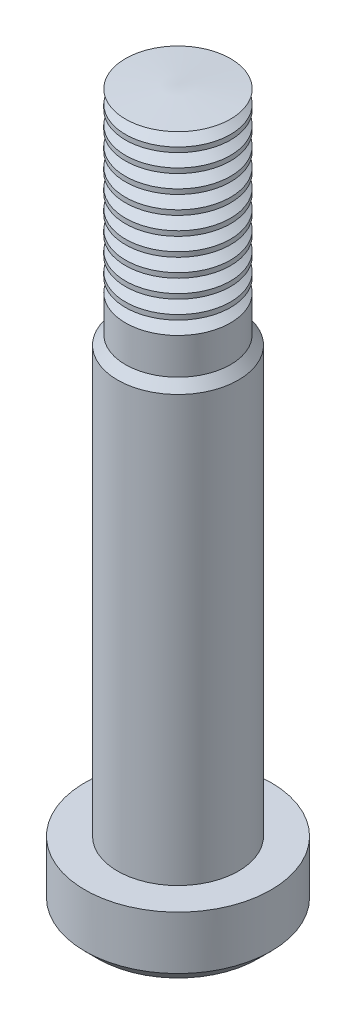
ISO-10303-21;
HEADER;
FILE_DESCRIPTION(('STEP AP214'),'2;1');
FILE_NAME('part.step','',(''),(''),'','','');
FILE_SCHEMA(('AUTOMOTIVE_DESIGN { 1 0 10303 214 1 1 1 1 }'));
ENDSEC;
DATA;
#1=APPLICATION_CONTEXT('core data for automotive mechanical design processes');
#2=APPLICATION_PROTOCOL_DEFINITION('international standard','automotive_design',2000,#1);
#3=PRODUCT_CONTEXT('',#1,'mechanical');
#4=PRODUCT('Part','Part','',(#3));
#5=PRODUCT_RELATED_PRODUCT_CATEGORY('part','',(#4));
#6=PRODUCT_DEFINITION_FORMATION('','',#4);
#7=PRODUCT_DEFINITION_CONTEXT('part definition',#1,'design');
#8=PRODUCT_DEFINITION('design','',#6,#7);
#9=PRODUCT_DEFINITION_SHAPE('','',#8);
#10=(LENGTH_UNIT() NAMED_UNIT(*) SI_UNIT(.MILLI.,.METRE.));
#11=(NAMED_UNIT(*) PLANE_ANGLE_UNIT() SI_UNIT($,.RADIAN.));
#12=(NAMED_UNIT(*) SI_UNIT($,.STERADIAN.) SOLID_ANGLE_UNIT());
#13=UNCERTAINTY_MEASURE_WITH_UNIT(LENGTH_MEASURE(1.E-05),#10,'distance_accuracy_value','');
#14=(GEOMETRIC_REPRESENTATION_CONTEXT(3) GLOBAL_UNCERTAINTY_ASSIGNED_CONTEXT((#13)) GLOBAL_UNIT_ASSIGNED_CONTEXT((#10,
#11,#12)) REPRESENTATION_CONTEXT('',''));
#15=CARTESIAN_POINT('',(0.,0.,0.));
#16=DIRECTION('',(0.,0.,1.));
#17=DIRECTION('',(1.,0.,0.));
#18=AXIS2_PLACEMENT_3D('',#15,#16,#17);
#19=CARTESIAN_POINT('',(0.,53.6722311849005,0.));
#20=DIRECTION('',(0.,-1.,0.));
#21=DIRECTION('',(0.,0.,-1.));
#22=AXIS2_PLACEMENT_3D('',#19,#20,#21);
#23=CONICAL_SURFACE('',#22,4.34610697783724,1.49552217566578);
#24=CARTESIAN_POINT('',(0.,53.9999999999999,0.));
#25=VERTEX_POINT('',#24);
#26=VERTEX_LOOP('',#25);
#27=FACE_BOUND('',#26,.T.);
#28=CARTESIAN_POINT('',(0.,53.7020283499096,0.));
#29=DIRECTION('',(0.,-1.,0.));
#30=DIRECTION('',(0.,0.,-1.));
#31=AXIS2_PLACEMENT_3D('',#28,#29,#30);
#32=CIRCLE('',#31,3.95100634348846);
#33=CARTESIAN_POINT('',(0.,53.7020283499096,-3.95100634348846));
#34=VERTEX_POINT('',#33);
#35=EDGE_CURVE('E35',#34,#34,#32,.T.);
#36=ORIENTED_EDGE('',*,*,#35,.F.);
#37=EDGE_LOOP('',(#36));
#38=FACE_BOUND('',#37,.T.);
#39=ADVANCED_FACE('F17',(#27,#38),#23,.T.);
#40=CARTESIAN_POINT('',(0.,53.7520283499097,0.));
#41=DIRECTION('',(0.,1.,0.));
#42=DIRECTION('',(0.,0.,1.));
#43=AXIS2_PLACEMENT_3D('',#40,#41,#42);
#44=CONICAL_SURFACE('',#43,4.03760888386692,1.04719755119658);
#45=ORIENTED_EDGE('',*,*,#35,.T.);
#46=EDGE_LOOP('',(#45));
#47=FACE_BOUND('',#46,.T.);
#48=CARTESIAN_POINT('',(0.,53.2020283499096,0.));
#49=DIRECTION('',(0.,-1.,0.));
#50=DIRECTION('',(0.,0.,-1.));
#51=AXIS2_PLACEMENT_3D('',#48,#49,#50);
#52=CIRCLE('',#51,3.08498093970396);
#53=CARTESIAN_POINT('',(0.,53.2020283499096,-3.08498093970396));
#54=VERTEX_POINT('',#53);
#55=EDGE_CURVE('E37',#54,#54,#52,.T.);
#56=ORIENTED_EDGE('',*,*,#55,.F.);
#57=EDGE_LOOP('',(#56));
#58=FACE_BOUND('',#57,.T.);
#59=ADVANCED_FACE('F31',(#47,#58),#44,.T.);
#60=CARTESIAN_POINT('',(0.,52.6520283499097,0.));
#61=DIRECTION('',(0.,-1.,0.));
#62=DIRECTION('',(0.,0.,-1.));
#63=AXIS2_PLACEMENT_3D('',#60,#61,#62);
#64=CONICAL_SURFACE('',#63,4.03760888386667,1.04719755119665);
#65=CARTESIAN_POINT('',(0.,52.7020283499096,0.));
#66=DIRECTION('',(0.,-1.,0.));
#67=DIRECTION('',(0.,0.,-1.));
#68=AXIS2_PLACEMENT_3D('',#65,#66,#67);
#69=CIRCLE('',#68,3.95100634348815);
#70=CARTESIAN_POINT('',(0.,52.7020283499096,-3.95100634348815));
#71=VERTEX_POINT('',#70);
#72=EDGE_CURVE('E40',#71,#71,#69,.T.);
#73=ORIENTED_EDGE('',*,*,#72,.F.);
#74=EDGE_LOOP('',(#73));
#75=FACE_BOUND('',#74,.T.);
#76=ORIENTED_EDGE('',*,*,#55,.T.);
#77=EDGE_LOOP('',(#76));
#78=FACE_BOUND('',#77,.T.);
#79=ADVANCED_FACE('F256',(#75,#78),#64,.T.);
#80=CARTESIAN_POINT('',(0.,52.7384667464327,0.));
#81=DIRECTION('',(0.,-1.,0.));
#82=DIRECTION('',(0.,0.,-1.));
#83=AXIS2_PLACEMENT_3D('',#80,#81,#82);
#84=CYLINDRICAL_SURFACE('',#83,3.95100634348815);
#85=CARTESIAN_POINT('',(1.15359111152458E-13,52.3376443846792,0.));
#86=DIRECTION('',(0.,-1.,0.));
#87=DIRECTION('',(0.,0.,-1.));
#88=AXIS2_PLACEMENT_3D('',#85,#86,#87);
#89=CIRCLE('',#88,3.95100634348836);
#90=CARTESIAN_POINT('',(1.15359111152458E-13,52.3376443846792,-3.95100634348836));
#91=VERTEX_POINT('',#90);
#92=EDGE_CURVE('E45',#91,#91,#89,.T.);
#93=ORIENTED_EDGE('',*,*,#92,.F.);
#94=EDGE_LOOP('',(#93));
#95=FACE_BOUND('',#94,.T.);
#96=ORIENTED_EDGE('',*,*,#72,.T.);
#97=EDGE_LOOP('',(#96));
#98=FACE_BOUND('',#97,.T.);
#99=ADVANCED_FACE('F263',(#95,#98),#84,.T.);
#100=CARTESIAN_POINT('',(1.27068494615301E-13,52.3876443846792,0.));
#101=DIRECTION('',(0.,1.,0.));
#102=DIRECTION('',(0.,0.,1.));
#103=AXIS2_PLACEMENT_3D('',#100,#101,#102);
#104=CONICAL_SURFACE('',#103,4.03760888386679,1.04719755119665);
#105=ORIENTED_EDGE('',*,*,#92,.T.);
#106=EDGE_LOOP('',(#105));
#107=FACE_BOUND('',#106,.T.);
#108=CARTESIAN_POINT('',(0.,51.8376443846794,0.));
#109=DIRECTION('',(0.,-1.,0.));
#110=DIRECTION('',(0.,0.,-1.));
#111=AXIS2_PLACEMENT_3D('',#108,#109,#110);
#112=CIRCLE('',#111,3.08498093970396);
#113=CARTESIAN_POINT('',(0.,51.8376443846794,-3.08498093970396));
#114=VERTEX_POINT('',#113);
#115=EDGE_CURVE('E48',#114,#114,#112,.T.);
#116=ORIENTED_EDGE('',*,*,#115,.F.);
#117=EDGE_LOOP('',(#116));
#118=FACE_BOUND('',#117,.T.);
#119=ADVANCED_FACE('F271',(#107,#118),#104,.T.);
#120=CARTESIAN_POINT('',(0.,51.2876443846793,0.));
#121=DIRECTION('',(0.,-1.,0.));
#122=DIRECTION('',(0.,0.,-1.));
#123=AXIS2_PLACEMENT_3D('',#120,#121,#122);
#124=CONICAL_SURFACE('',#123,4.03760888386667,1.04719755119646);
#125=CARTESIAN_POINT('',(0.,51.3376443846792,0.));
#126=DIRECTION('',(0.,-1.,0.));
#127=DIRECTION('',(0.,0.,-1.));
#128=AXIS2_PLACEMENT_3D('',#125,#126,#127);
#129=CIRCLE('',#128,3.95100634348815);
#130=CARTESIAN_POINT('',(0.,51.3376443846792,-3.95100634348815));
#131=VERTEX_POINT('',#130);
#132=EDGE_CURVE('E51',#131,#131,#129,.T.);
#133=ORIENTED_EDGE('',*,*,#132,.F.);
#134=EDGE_LOOP('',(#133));
#135=FACE_BOUND('',#134,.T.);
#136=ORIENTED_EDGE('',*,*,#115,.T.);
#137=EDGE_LOOP('',(#136));
#138=FACE_BOUND('',#137,.T.);
#139=ADVANCED_FACE('F279',(#135,#138),#124,.T.);
#140=CARTESIAN_POINT('',(0.,51.3740827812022,0.));
#141=DIRECTION('',(0.,-1.,0.));
#142=DIRECTION('',(0.,0.,-1.));
#143=AXIS2_PLACEMENT_3D('',#140,#141,#142);
#144=CYLINDRICAL_SURFACE('',#143,3.95100634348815);
#145=CARTESIAN_POINT('',(1.15359111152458E-13,50.9732604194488,0.));
#146=DIRECTION('',(0.,-1.,0.));
#147=DIRECTION('',(0.,0.,-1.));
#148=AXIS2_PLACEMENT_3D('',#145,#146,#147);
#149=CIRCLE('',#148,3.95100634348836);
#150=CARTESIAN_POINT('',(1.15359111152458E-13,50.9732604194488,-3.95100634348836));
#151=VERTEX_POINT('',#150);
#152=EDGE_CURVE('E54',#151,#151,#149,.T.);
#153=ORIENTED_EDGE('',*,*,#152,.F.);
#154=EDGE_LOOP('',(#153));
#155=FACE_BOUND('',#154,.T.);
#156=ORIENTED_EDGE('',*,*,#132,.T.);
#157=EDGE_LOOP('',(#156));
#158=FACE_BOUND('',#157,.T.);
#159=ADVANCED_FACE('F287',(#155,#158),#144,.T.);
#160=CARTESIAN_POINT('',(1.27068494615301E-13,51.0232604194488,0.));
#161=DIRECTION('',(0.,1.,0.));
#162=DIRECTION('',(0.,0.,1.));
#163=AXIS2_PLACEMENT_3D('',#160,#161,#162);
#164=CONICAL_SURFACE('',#163,4.03760888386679,1.04719755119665);
#165=ORIENTED_EDGE('',*,*,#152,.T.);
#166=EDGE_LOOP('',(#165));
#167=FACE_BOUND('',#166,.T.);
#168=CARTESIAN_POINT('',(0.,50.473260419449,0.));
#169=DIRECTION('',(0.,-1.,0.));
#170=DIRECTION('',(0.,0.,-1.));
#171=AXIS2_PLACEMENT_3D('',#168,#169,#170);
#172=CIRCLE('',#171,3.08498093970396);
#173=CARTESIAN_POINT('',(0.,50.473260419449,-3.08498093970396));
#174=VERTEX_POINT('',#173);
#175=EDGE_CURVE('E57',#174,#174,#172,.T.);
#176=ORIENTED_EDGE('',*,*,#175,.F.);
#177=EDGE_LOOP('',(#176));
#178=FACE_BOUND('',#177,.T.);
#179=ADVANCED_FACE('F295',(#167,#178),#164,.T.);
#180=CARTESIAN_POINT('',(0.,49.9232604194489,0.));
#181=DIRECTION('',(0.,-1.,0.));
#182=DIRECTION('',(0.,0.,-1.));
#183=AXIS2_PLACEMENT_3D('',#180,#181,#182);
#184=CONICAL_SURFACE('',#183,4.03760888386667,1.04719755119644);
#185=CARTESIAN_POINT('',(0.,49.9732604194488,0.));
#186=DIRECTION('',(0.,-1.,0.));
#187=DIRECTION('',(0.,0.,-1.));
#188=AXIS2_PLACEMENT_3D('',#185,#186,#187);
#189=CIRCLE('',#188,3.95100634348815);
#190=CARTESIAN_POINT('',(0.,49.9732604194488,-3.95100634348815));
#191=VERTEX_POINT('',#190);
#192=EDGE_CURVE('E60',#191,#191,#189,.T.);
#193=ORIENTED_EDGE('',*,*,#192,.F.);
#194=EDGE_LOOP('',(#193));
#195=FACE_BOUND('',#194,.T.);
#196=ORIENTED_EDGE('',*,*,#175,.T.);
#197=EDGE_LOOP('',(#196));
#198=FACE_BOUND('',#197,.T.);
#199=ADVANCED_FACE('F303',(#195,#198),#184,.T.);
#200=CARTESIAN_POINT('',(0.,50.0096988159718,0.));
#201=DIRECTION('',(0.,-1.,0.));
#202=DIRECTION('',(0.,0.,-1.));
#203=AXIS2_PLACEMENT_3D('',#200,#201,#202);
#204=CYLINDRICAL_SURFACE('',#203,3.95100634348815);
#205=CARTESIAN_POINT('',(1.15359111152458E-13,49.6088764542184,0.));
#206=DIRECTION('',(0.,-1.,0.));
#207=DIRECTION('',(0.,0.,-1.));
#208=AXIS2_PLACEMENT_3D('',#205,#206,#207);
#209=CIRCLE('',#208,3.95100634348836);
#210=CARTESIAN_POINT('',(1.15359111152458E-13,49.6088764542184,-3.95100634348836));
#211=VERTEX_POINT('',#210);
#212=EDGE_CURVE('E63',#211,#211,#209,.T.);
#213=ORIENTED_EDGE('',*,*,#212,.F.);
#214=EDGE_LOOP('',(#213));
#215=FACE_BOUND('',#214,.T.);
#216=ORIENTED_EDGE('',*,*,#192,.T.);
#217=EDGE_LOOP('',(#216));
#218=FACE_BOUND('',#217,.T.);
#219=ADVANCED_FACE('F311',(#215,#218),#204,.T.);
#220=CARTESIAN_POINT('',(1.27068494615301E-13,49.6588764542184,0.));
#221=DIRECTION('',(0.,1.,0.));
#222=DIRECTION('',(0.,0.,1.));
#223=AXIS2_PLACEMENT_3D('',#220,#221,#222);
#224=CONICAL_SURFACE('',#223,4.03760888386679,1.04719755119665);
#225=ORIENTED_EDGE('',*,*,#212,.T.);
#226=EDGE_LOOP('',(#225));
#227=FACE_BOUND('',#226,.T.);
#228=CARTESIAN_POINT('',(0.,49.1088764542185,0.));
#229=DIRECTION('',(0.,-1.,0.));
#230=DIRECTION('',(0.,0.,-1.));
#231=AXIS2_PLACEMENT_3D('',#228,#229,#230);
#232=CIRCLE('',#231,3.08498093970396);
#233=CARTESIAN_POINT('',(0.,49.1088764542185,-3.08498093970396));
#234=VERTEX_POINT('',#233);
#235=EDGE_CURVE('E66',#234,#234,#232,.T.);
#236=ORIENTED_EDGE('',*,*,#235,.F.);
#237=EDGE_LOOP('',(#236));
#238=FACE_BOUND('',#237,.T.);
#239=ADVANCED_FACE('F319',(#227,#238),#224,.T.);
#240=CARTESIAN_POINT('',(0.,48.5588764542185,0.));
#241=DIRECTION('',(0.,-1.,0.));
#242=DIRECTION('',(0.,0.,-1.));
#243=AXIS2_PLACEMENT_3D('',#240,#241,#242);
#244=CONICAL_SURFACE('',#243,4.03760888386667,1.04719755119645);
#245=CARTESIAN_POINT('',(0.,48.6088764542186,0.));
#246=DIRECTION('',(0.,-1.,0.));
#247=DIRECTION('',(0.,0.,-1.));
#248=AXIS2_PLACEMENT_3D('',#245,#246,#247);
#249=CIRCLE('',#248,3.95100634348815);
#250=CARTESIAN_POINT('',(0.,48.6088764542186,-3.95100634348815));
#251=VERTEX_POINT('',#250);
#252=EDGE_CURVE('E69',#251,#251,#249,.T.);
#253=ORIENTED_EDGE('',*,*,#252,.F.);
#254=EDGE_LOOP('',(#253));
#255=FACE_BOUND('',#254,.T.);
#256=ORIENTED_EDGE('',*,*,#235,.T.);
#257=EDGE_LOOP('',(#256));
#258=FACE_BOUND('',#257,.T.);
#259=ADVANCED_FACE('F327',(#255,#258),#244,.T.);
#260=CARTESIAN_POINT('',(0.,48.6453148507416,0.));
#261=DIRECTION('',(0.,-1.,0.));
#262=DIRECTION('',(0.,0.,-1.));
#263=AXIS2_PLACEMENT_3D('',#260,#261,#262);
#264=CYLINDRICAL_SURFACE('',#263,3.95100634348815);
#265=CARTESIAN_POINT('',(1.15359111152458E-13,48.244492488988,0.));
#266=DIRECTION('',(0.,-1.,0.));
#267=DIRECTION('',(0.,0.,-1.));
#268=AXIS2_PLACEMENT_3D('',#265,#266,#267);
#269=CIRCLE('',#268,3.95100634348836);
#270=CARTESIAN_POINT('',(1.15359111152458E-13,48.244492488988,-3.95100634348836));
#271=VERTEX_POINT('',#270);
#272=EDGE_CURVE('E72',#271,#271,#269,.T.);
#273=ORIENTED_EDGE('',*,*,#272,.F.);
#274=EDGE_LOOP('',(#273));
#275=FACE_BOUND('',#274,.T.);
#276=ORIENTED_EDGE('',*,*,#252,.T.);
#277=EDGE_LOOP('',(#276));
#278=FACE_BOUND('',#277,.T.);
#279=ADVANCED_FACE('F335',(#275,#278),#264,.T.);
#280=CARTESIAN_POINT('',(1.27068494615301E-13,48.294492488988,0.));
#281=DIRECTION('',(0.,1.,0.));
#282=DIRECTION('',(0.,0.,1.));
#283=AXIS2_PLACEMENT_3D('',#280,#281,#282);
#284=CONICAL_SURFACE('',#283,4.03760888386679,1.04719755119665);
#285=ORIENTED_EDGE('',*,*,#272,.T.);
#286=EDGE_LOOP('',(#285));
#287=FACE_BOUND('',#286,.T.);
#288=CARTESIAN_POINT('',(0.,47.7444924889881,0.));
#289=DIRECTION('',(0.,-1.,0.));
#290=DIRECTION('',(0.,0.,-1.));
#291=AXIS2_PLACEMENT_3D('',#288,#289,#290);
#292=CIRCLE('',#291,3.08498093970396);
#293=CARTESIAN_POINT('',(0.,47.7444924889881,-3.08498093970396));
#294=VERTEX_POINT('',#293);
#295=EDGE_CURVE('E75',#294,#294,#292,.T.);
#296=ORIENTED_EDGE('',*,*,#295,.F.);
#297=EDGE_LOOP('',(#296));
#298=FACE_BOUND('',#297,.T.);
#299=ADVANCED_FACE('F343',(#287,#298),#284,.T.);
#300=CARTESIAN_POINT('',(0.,47.1944924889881,0.));
#301=DIRECTION('',(0.,-1.,0.));
#302=DIRECTION('',(0.,0.,-1.));
#303=AXIS2_PLACEMENT_3D('',#300,#301,#302);
#304=CONICAL_SURFACE('',#303,4.03760888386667,1.04719755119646);
#305=CARTESIAN_POINT('',(0.,47.2444924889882,0.));
#306=DIRECTION('',(0.,-1.,0.));
#307=DIRECTION('',(0.,0.,-1.));
#308=AXIS2_PLACEMENT_3D('',#305,#306,#307);
#309=CIRCLE('',#308,3.95100634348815);
#310=CARTESIAN_POINT('',(0.,47.2444924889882,-3.95100634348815));
#311=VERTEX_POINT('',#310);
#312=EDGE_CURVE('E78',#311,#311,#309,.T.);
#313=ORIENTED_EDGE('',*,*,#312,.F.);
#314=EDGE_LOOP('',(#313));
#315=FACE_BOUND('',#314,.T.);
#316=ORIENTED_EDGE('',*,*,#295,.T.);
#317=EDGE_LOOP('',(#316));
#318=FACE_BOUND('',#317,.T.);
#319=ADVANCED_FACE('F351',(#315,#318),#304,.T.);
#320=CARTESIAN_POINT('',(0.,47.2809308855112,0.));
#321=DIRECTION('',(0.,-1.,0.));
#322=DIRECTION('',(0.,0.,-1.));
#323=AXIS2_PLACEMENT_3D('',#320,#321,#322);
#324=CYLINDRICAL_SURFACE('',#323,3.95100634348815);
#325=CARTESIAN_POINT('',(1.15359111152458E-13,46.8801085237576,0.));
#326=DIRECTION('',(0.,-1.,0.));
#327=DIRECTION('',(0.,0.,-1.));
#328=AXIS2_PLACEMENT_3D('',#325,#326,#327);
#329=CIRCLE('',#328,3.95100634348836);
#330=CARTESIAN_POINT('',(1.15359111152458E-13,46.8801085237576,-3.95100634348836));
#331=VERTEX_POINT('',#330);
#332=EDGE_CURVE('E81',#331,#331,#329,.T.);
#333=ORIENTED_EDGE('',*,*,#332,.F.);
#334=EDGE_LOOP('',(#333));
#335=FACE_BOUND('',#334,.T.);
#336=ORIENTED_EDGE('',*,*,#312,.T.);
#337=EDGE_LOOP('',(#336));
#338=FACE_BOUND('',#337,.T.);
#339=ADVANCED_FACE('F359',(#335,#338),#324,.T.);
#340=CARTESIAN_POINT('',(1.27068494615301E-13,46.9301085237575,0.));
#341=DIRECTION('',(0.,1.,0.));
#342=DIRECTION('',(0.,0.,1.));
#343=AXIS2_PLACEMENT_3D('',#340,#341,#342);
#344=CONICAL_SURFACE('',#343,4.03760888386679,1.04719755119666);
#345=ORIENTED_EDGE('',*,*,#332,.T.);
#346=EDGE_LOOP('',(#345));
#347=FACE_BOUND('',#346,.T.);
#348=CARTESIAN_POINT('',(0.,46.3801085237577,0.));
#349=DIRECTION('',(0.,-1.,0.));
#350=DIRECTION('',(0.,0.,-1.));
#351=AXIS2_PLACEMENT_3D('',#348,#349,#350);
#352=CIRCLE('',#351,3.08498093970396);
#353=CARTESIAN_POINT('',(0.,46.3801085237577,-3.08498093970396));
#354=VERTEX_POINT('',#353);
#355=EDGE_CURVE('E84',#354,#354,#352,.T.);
#356=ORIENTED_EDGE('',*,*,#355,.F.);
#357=EDGE_LOOP('',(#356));
#358=FACE_BOUND('',#357,.T.);
#359=ADVANCED_FACE('F367',(#347,#358),#344,.T.);
#360=CARTESIAN_POINT('',(0.,45.8301085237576,0.));
#361=DIRECTION('',(0.,-1.,0.));
#362=DIRECTION('',(0.,0.,-1.));
#363=AXIS2_PLACEMENT_3D('',#360,#361,#362);
#364=CONICAL_SURFACE('',#363,4.03760888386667,1.04719755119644);
#365=CARTESIAN_POINT('',(0.,45.8801085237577,0.));
#366=DIRECTION('',(0.,-1.,0.));
#367=DIRECTION('',(0.,0.,-1.));
#368=AXIS2_PLACEMENT_3D('',#365,#366,#367);
#369=CIRCLE('',#368,3.95100634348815);
#370=CARTESIAN_POINT('',(0.,45.8801085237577,-3.95100634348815));
#371=VERTEX_POINT('',#370);
#372=EDGE_CURVE('E87',#371,#371,#369,.T.);
#373=ORIENTED_EDGE('',*,*,#372,.F.);
#374=EDGE_LOOP('',(#373));
#375=FACE_BOUND('',#374,.T.);
#376=ORIENTED_EDGE('',*,*,#355,.T.);
#377=EDGE_LOOP('',(#376));
#378=FACE_BOUND('',#377,.T.);
#379=ADVANCED_FACE('F375',(#375,#378),#364,.T.);
#380=CARTESIAN_POINT('',(0.,45.9165469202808,0.));
#381=DIRECTION('',(0.,-1.,0.));
#382=DIRECTION('',(0.,0.,-1.));
#383=AXIS2_PLACEMENT_3D('',#380,#381,#382);
#384=CYLINDRICAL_SURFACE('',#383,3.95100634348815);
#385=CARTESIAN_POINT('',(1.15359111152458E-13,45.5157245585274,0.));
#386=DIRECTION('',(0.,-1.,0.));
#387=DIRECTION('',(0.,0.,-1.));
#388=AXIS2_PLACEMENT_3D('',#385,#386,#387);
#389=CIRCLE('',#388,3.95100634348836);
#390=CARTESIAN_POINT('',(1.15359111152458E-13,45.5157245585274,-3.95100634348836));
#391=VERTEX_POINT('',#390);
#392=EDGE_CURVE('E90',#391,#391,#389,.T.);
#393=ORIENTED_EDGE('',*,*,#392,.F.);
#394=EDGE_LOOP('',(#393));
#395=FACE_BOUND('',#394,.T.);
#396=ORIENTED_EDGE('',*,*,#372,.T.);
#397=EDGE_LOOP('',(#396));
#398=FACE_BOUND('',#397,.T.);
#399=ADVANCED_FACE('F383',(#395,#398),#384,.T.);
#400=CARTESIAN_POINT('',(1.27068494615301E-13,45.5657245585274,0.));
#401=DIRECTION('',(0.,1.,0.));
#402=DIRECTION('',(0.,0.,1.));
#403=AXIS2_PLACEMENT_3D('',#400,#401,#402);
#404=CONICAL_SURFACE('',#403,4.03760888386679,1.04719755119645);
#405=ORIENTED_EDGE('',*,*,#392,.T.);
#406=EDGE_LOOP('',(#405));
#407=FACE_BOUND('',#406,.T.);
#408=CARTESIAN_POINT('',(0.,45.0157245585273,0.));
#409=DIRECTION('',(0.,-1.,0.));
#410=DIRECTION('',(0.,0.,-1.));
#411=AXIS2_PLACEMENT_3D('',#408,#409,#410);
#412=CIRCLE('',#411,3.08498093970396);
#413=CARTESIAN_POINT('',(0.,45.0157245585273,-3.08498093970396));
#414=VERTEX_POINT('',#413);
#415=EDGE_CURVE('E93',#414,#414,#412,.T.);
#416=ORIENTED_EDGE('',*,*,#415,.F.);
#417=EDGE_LOOP('',(#416));
#418=FACE_BOUND('',#417,.T.);
#419=ADVANCED_FACE('F391',(#407,#418),#404,.T.);
#420=CARTESIAN_POINT('',(0.,44.4657245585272,0.));
#421=DIRECTION('',(0.,-1.,0.));
#422=DIRECTION('',(0.,0.,-1.));
#423=AXIS2_PLACEMENT_3D('',#420,#421,#422);
#424=CONICAL_SURFACE('',#423,4.03760888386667,1.04719755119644);
#425=CARTESIAN_POINT('',(0.,44.5157245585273,0.));
#426=DIRECTION('',(0.,-1.,0.));
#427=DIRECTION('',(0.,0.,-1.));
#428=AXIS2_PLACEMENT_3D('',#425,#426,#427);
#429=CIRCLE('',#428,3.95100634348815);
#430=CARTESIAN_POINT('',(0.,44.5157245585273,-3.95100634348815));
#431=VERTEX_POINT('',#430);
#432=EDGE_CURVE('E96',#431,#431,#429,.T.);
#433=ORIENTED_EDGE('',*,*,#432,.F.);
#434=EDGE_LOOP('',(#433));
#435=FACE_BOUND('',#434,.T.);
#436=ORIENTED_EDGE('',*,*,#415,.T.);
#437=EDGE_LOOP('',(#436));
#438=FACE_BOUND('',#437,.T.);
#439=ADVANCED_FACE('F399',(#435,#438),#424,.T.);
#440=CARTESIAN_POINT('',(0.,44.5521629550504,0.));
#441=DIRECTION('',(0.,-1.,0.));
#442=DIRECTION('',(0.,0.,-1.));
#443=AXIS2_PLACEMENT_3D('',#440,#441,#442);
#444=CYLINDRICAL_SURFACE('',#443,3.95100634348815);
#445=CARTESIAN_POINT('',(1.15359111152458E-13,44.151340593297,0.));
#446=DIRECTION('',(0.,-1.,0.));
#447=DIRECTION('',(0.,0.,-1.));
#448=AXIS2_PLACEMENT_3D('',#445,#446,#447);
#449=CIRCLE('',#448,3.95100634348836);
#450=CARTESIAN_POINT('',(1.15359111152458E-13,44.151340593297,-3.95100634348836));
#451=VERTEX_POINT('',#450);
#452=EDGE_CURVE('E99',#451,#451,#449,.T.);
#453=ORIENTED_EDGE('',*,*,#452,.F.);
#454=EDGE_LOOP('',(#453));
#455=FACE_BOUND('',#454,.T.);
#456=ORIENTED_EDGE('',*,*,#432,.T.);
#457=EDGE_LOOP('',(#456));
#458=FACE_BOUND('',#457,.T.);
#459=ADVANCED_FACE('F407',(#455,#458),#444,.T.);
#460=CARTESIAN_POINT('',(1.27068494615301E-13,44.201340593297,0.));
#461=DIRECTION('',(0.,1.,0.));
#462=DIRECTION('',(0.,0.,1.));
#463=AXIS2_PLACEMENT_3D('',#460,#461,#462);
#464=CONICAL_SURFACE('',#463,4.03760888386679,1.04719755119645);
#465=ORIENTED_EDGE('',*,*,#452,.T.);
#466=EDGE_LOOP('',(#465));
#467=FACE_BOUND('',#466,.T.);
#468=CARTESIAN_POINT('',(0.,43.6513405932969,0.));
#469=DIRECTION('',(0.,-1.,0.));
#470=DIRECTION('',(0.,0.,-1.));
#471=AXIS2_PLACEMENT_3D('',#468,#469,#470);
#472=CIRCLE('',#471,3.08498093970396);
#473=CARTESIAN_POINT('',(0.,43.6513405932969,-3.08498093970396));
#474=VERTEX_POINT('',#473);
#475=EDGE_CURVE('E102',#474,#474,#472,.T.);
#476=ORIENTED_EDGE('',*,*,#475,.F.);
#477=EDGE_LOOP('',(#476));
#478=FACE_BOUND('',#477,.T.);
#479=ADVANCED_FACE('F415',(#467,#478),#464,.T.);
#480=CARTESIAN_POINT('',(0.,43.1013405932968,0.));
#481=DIRECTION('',(0.,-1.,0.));
#482=DIRECTION('',(0.,0.,-1.));
#483=AXIS2_PLACEMENT_3D('',#480,#481,#482);
#484=CONICAL_SURFACE('',#483,4.03760888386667,1.04719755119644);
#485=CARTESIAN_POINT('',(0.,43.1513405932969,0.));
#486=DIRECTION('',(0.,-1.,0.));
#487=DIRECTION('',(0.,0.,-1.));
#488=AXIS2_PLACEMENT_3D('',#485,#486,#487);
#489=CIRCLE('',#488,3.95100634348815);
#490=CARTESIAN_POINT('',(0.,43.1513405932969,-3.95100634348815));
#491=VERTEX_POINT('',#490);
#492=EDGE_CURVE('E105',#491,#491,#489,.T.);
#493=ORIENTED_EDGE('',*,*,#492,.F.);
#494=EDGE_LOOP('',(#493));
#495=FACE_BOUND('',#494,.T.);
#496=ORIENTED_EDGE('',*,*,#475,.T.);
#497=EDGE_LOOP('',(#496));
#498=FACE_BOUND('',#497,.T.);
#499=ADVANCED_FACE('F423',(#495,#498),#484,.T.);
#500=CARTESIAN_POINT('',(0.,43.18777898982,0.));
#501=DIRECTION('',(0.,-1.,0.));
#502=DIRECTION('',(0.,0.,-1.));
#503=AXIS2_PLACEMENT_3D('',#500,#501,#502);
#504=CYLINDRICAL_SURFACE('',#503,3.95100634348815);
#505=CARTESIAN_POINT('',(1.15359111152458E-13,42.7869566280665,0.));
#506=DIRECTION('',(0.,-1.,0.));
#507=DIRECTION('',(0.,0.,-1.));
#508=AXIS2_PLACEMENT_3D('',#505,#506,#507);
#509=CIRCLE('',#508,3.95100634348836);
#510=CARTESIAN_POINT('',(1.15359111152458E-13,42.7869566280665,-3.95100634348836));
#511=VERTEX_POINT('',#510);
#512=EDGE_CURVE('E108',#511,#511,#509,.T.);
#513=ORIENTED_EDGE('',*,*,#512,.F.);
#514=EDGE_LOOP('',(#513));
#515=FACE_BOUND('',#514,.T.);
#516=ORIENTED_EDGE('',*,*,#492,.T.);
#517=EDGE_LOOP('',(#516));
#518=FACE_BOUND('',#517,.T.);
#519=ADVANCED_FACE('F431',(#515,#518),#504,.T.);
#520=CARTESIAN_POINT('',(-6.0720000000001,0.,-6.0720000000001));
#521=DIRECTION('',(0.,-1.,0.));
#522=DIRECTION('',(1.,0.,0.));
#523=AXIS2_PLACEMENT_3D('',#520,#521,#522);
#524=PLANE('',#523);
#525=CARTESIAN_POINT('',(0.,0.,0.));
#526=DIRECTION('',(0.,1.,0.));
#527=DIRECTION('',(0.,0.,1.));
#528=AXIS2_PLACEMENT_3D('',#525,#526,#527);
#529=CIRCLE('',#528,5.99999999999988);
#530=CARTESIAN_POINT('',(0.,0.,5.99999999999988));
#531=VERTEX_POINT('',#530);
#532=EDGE_CURVE('E21',#531,#531,#529,.T.);
#533=ORIENTED_EDGE('',*,*,#532,.F.);
#534=EDGE_LOOP('',(#533));
#535=FACE_BOUND('',#534,.T.);
#536=ADVANCED_FACE('F160',(#535),#524,.T.);
#537=CARTESIAN_POINT('',(1.27068494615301E-13,42.8369566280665,0.));
#538=DIRECTION('',(0.,1.,0.));
#539=DIRECTION('',(0.,0.,1.));
#540=AXIS2_PLACEMENT_3D('',#537,#538,#539);
#541=CONICAL_SURFACE('',#540,4.03760888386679,1.04719755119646);
#542=ORIENTED_EDGE('',*,*,#512,.T.);
#543=EDGE_LOOP('',(#542));
#544=FACE_BOUND('',#543,.T.);
#545=CARTESIAN_POINT('',(0.,42.2869566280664,0.));
#546=DIRECTION('',(0.,-1.,0.));
#547=DIRECTION('',(0.,0.,-1.));
#548=AXIS2_PLACEMENT_3D('',#545,#546,#547);
#549=CIRCLE('',#548,3.08498093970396);
#550=CARTESIAN_POINT('',(0.,42.2869566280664,-3.08498093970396));
#551=VERTEX_POINT('',#550);
#552=EDGE_CURVE('E111',#551,#551,#549,.T.);
#553=ORIENTED_EDGE('',*,*,#552,.F.);
#554=EDGE_LOOP('',(#553));
#555=FACE_BOUND('',#554,.T.);
#556=ADVANCED_FACE('F149',(#544,#555),#541,.T.);
#557=CARTESIAN_POINT('',(0.,1.09999999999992,0.));
#558=DIRECTION('',(0.,1.,0.));
#559=DIRECTION('',(0.,0.,1.));
#560=AXIS2_PLACEMENT_3D('',#557,#558,#559);
#561=CONICAL_SURFACE('',#560,7.10000000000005,0.785398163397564);
#562=ORIENTED_EDGE('',*,*,#532,.T.);
#563=EDGE_LOOP('',(#562));
#564=FACE_BOUND('',#563,.T.);
#565=CARTESIAN_POINT('',(0.,0.999999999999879,0.));
#566=DIRECTION('',(0.,1.,0.));
#567=DIRECTION('',(0.,0.,1.));
#568=AXIS2_PLACEMENT_3D('',#565,#566,#567);
#569=CIRCLE('',#568,6.99999999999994);
#570=CARTESIAN_POINT('',(0.,0.999999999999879,6.99999999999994));
#571=VERTEX_POINT('',#570);
#572=EDGE_CURVE('E114',#571,#571,#569,.T.);
#573=ORIENTED_EDGE('',*,*,#572,.F.);
#574=EDGE_LOOP('',(#573));
#575=FACE_BOUND('',#574,.T.);
#576=ADVANCED_FACE('F147',(#564,#575),#561,.T.);
#577=CARTESIAN_POINT('',(0.,41.7369566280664,0.));
#578=DIRECTION('',(0.,-1.,0.));
#579=DIRECTION('',(0.,0.,-1.));
#580=AXIS2_PLACEMENT_3D('',#577,#578,#579);
#581=CONICAL_SURFACE('',#580,4.03760888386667,1.04719755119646);
#582=CARTESIAN_POINT('',(0.,41.7869566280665,0.));
#583=DIRECTION('',(0.,-1.,0.));
#584=DIRECTION('',(0.,0.,-1.));
#585=AXIS2_PLACEMENT_3D('',#582,#583,#584);
#586=CIRCLE('',#585,3.95100634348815);
#587=CARTESIAN_POINT('',(0.,41.7869566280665,-3.95100634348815));
#588=VERTEX_POINT('',#587);
#589=EDGE_CURVE('E115',#588,#588,#586,.T.);
#590=ORIENTED_EDGE('',*,*,#589,.F.);
#591=EDGE_LOOP('',(#590));
#592=FACE_BOUND('',#591,.T.);
#593=ORIENTED_EDGE('',*,*,#552,.T.);
#594=EDGE_LOOP('',(#593));
#595=FACE_BOUND('',#594,.T.);
#596=ADVANCED_FACE('F143',(#592,#595),#581,.T.);
#597=CARTESIAN_POINT('',(0.,5.39999999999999,0.));
#598=DIRECTION('',(0.,-1.,0.));
#599=DIRECTION('',(0.,0.,-1.));
#600=AXIS2_PLACEMENT_3D('',#597,#598,#599);
#601=CYLINDRICAL_SURFACE('',#600,6.99999999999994);
#602=CARTESIAN_POINT('',(0.,5.00000000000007,0.));
#603=DIRECTION('',(0.,-1.,0.));
#604=DIRECTION('',(0.,0.,-1.));
#605=AXIS2_PLACEMENT_3D('',#602,#603,#604);
#606=CIRCLE('',#605,6.99999999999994);
#607=CARTESIAN_POINT('',(0.,5.00000000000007,-6.99999999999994));
#608=VERTEX_POINT('',#607);
#609=EDGE_CURVE('E118',#608,#608,#606,.F.);
#610=ORIENTED_EDGE('',*,*,#609,.F.);
#611=EDGE_LOOP('',(#610));
#612=FACE_BOUND('',#611,.T.);
#613=ORIENTED_EDGE('',*,*,#572,.T.);
#614=EDGE_LOOP('',(#613));
#615=FACE_BOUND('',#614,.T.);
#616=ADVANCED_FACE('F139',(#612,#615),#601,.T.);
#617=CARTESIAN_POINT('',(0.,41.8233950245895,0.));
#618=DIRECTION('',(0.,-1.,0.));
#619=DIRECTION('',(0.,0.,-1.));
#620=AXIS2_PLACEMENT_3D('',#617,#618,#619);
#621=CYLINDRICAL_SURFACE('',#620,3.95100634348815);
#622=CARTESIAN_POINT('',(1.15359111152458E-13,41.4225726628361,0.));
#623=DIRECTION('',(0.,-1.,0.));
#624=DIRECTION('',(0.,0.,-1.));
#625=AXIS2_PLACEMENT_3D('',#622,#623,#624);
#626=CIRCLE('',#625,3.95100634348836);
#627=CARTESIAN_POINT('',(1.15359111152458E-13,41.4225726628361,-3.95100634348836));
#628=VERTEX_POINT('',#627);
#629=EDGE_CURVE('E119',#628,#628,#626,.T.);
#630=ORIENTED_EDGE('',*,*,#629,.F.);
#631=EDGE_LOOP('',(#630));
#632=FACE_BOUND('',#631,.T.);
#633=ORIENTED_EDGE('',*,*,#589,.T.);
#634=EDGE_LOOP('',(#633));
#635=FACE_BOUND('',#634,.T.);
#636=ADVANCED_FACE('F142',(#632,#635),#621,.T.);
#637=CARTESIAN_POINT('',(7.08400000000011,5.00000000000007,-7.08400000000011));
#638=DIRECTION('',(0.,1.,0.));
#639=DIRECTION('',(-1.,0.,0.));
#640=AXIS2_PLACEMENT_3D('',#637,#638,#639);
#641=PLANE('',#640);
#642=CARTESIAN_POINT('',(0.,5.00000000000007,0.));
#643=DIRECTION('',(0.,-1.,0.));
#644=DIRECTION('',(0.,0.,-1.));
#645=AXIS2_PLACEMENT_3D('',#642,#643,#644);
#646=CIRCLE('',#645,4.55000000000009);
#647=CARTESIAN_POINT('',(0.,5.00000000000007,-4.55000000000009));
#648=VERTEX_POINT('',#647);
#649=EDGE_CURVE('E122',#648,#648,#646,.F.);
#650=ORIENTED_EDGE('',*,*,#649,.F.);
#651=EDGE_LOOP('',(#650));
#652=FACE_BOUND('',#651,.T.);
#653=ORIENTED_EDGE('',*,*,#609,.T.);
#654=EDGE_LOOP('',(#653));
#655=FACE_BOUND('',#654,.T.);
#656=ADVANCED_FACE('F137',(#652,#655),#641,.T.);
#657=CARTESIAN_POINT('',(1.27068494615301E-13,41.4725726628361,0.));
#658=DIRECTION('',(0.,1.,0.));
#659=DIRECTION('',(0.,0.,1.));
#660=AXIS2_PLACEMENT_3D('',#657,#658,#659);
#661=CONICAL_SURFACE('',#660,4.03760888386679,1.04719755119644);
#662=ORIENTED_EDGE('',*,*,#629,.T.);
#663=EDGE_LOOP('',(#662));
#664=FACE_BOUND('',#663,.T.);
#665=CARTESIAN_POINT('',(0.,40.922572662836,0.));
#666=DIRECTION('',(0.,-1.,0.));
#667=DIRECTION('',(0.,0.,-1.));
#668=AXIS2_PLACEMENT_3D('',#665,#666,#667);
#669=CIRCLE('',#668,3.08498093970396);
#670=CARTESIAN_POINT('',(0.,40.922572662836,-3.08498093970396));
#671=VERTEX_POINT('',#670);
#672=EDGE_CURVE('E123',#671,#671,#669,.T.);
#673=ORIENTED_EDGE('',*,*,#672,.F.);
#674=EDGE_LOOP('',(#673));
#675=FACE_BOUND('',#674,.T.);
#676=ADVANCED_FACE('F183',(#664,#675),#661,.T.);
#677=CARTESIAN_POINT('',(0.,37.0000000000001,0.));
#678=DIRECTION('',(0.,-1.,0.));
#679=DIRECTION('',(0.,0.,-1.));
#680=AXIS2_PLACEMENT_3D('',#677,#678,#679);
#681=CYLINDRICAL_SURFACE('',#680,4.55000000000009);
#682=ORIENTED_EDGE('',*,*,#649,.T.);
#683=EDGE_LOOP('',(#682));
#684=FACE_BOUND('',#683,.T.);
#685=CARTESIAN_POINT('',(0.,37.,0.));
#686=DIRECTION('',(0.,1.,0.));
#687=DIRECTION('',(0.,0.,1.));
#688=AXIS2_PLACEMENT_3D('',#685,#686,#687);
#689=CIRCLE('',#688,4.55000000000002);
#690=CARTESIAN_POINT('',(0.,37.,4.55000000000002));
#691=VERTEX_POINT('',#690);
#692=EDGE_CURVE('E125',#691,#691,#689,.T.);
#693=ORIENTED_EDGE('',*,*,#692,.F.);
#694=EDGE_LOOP('',(#693));
#695=FACE_BOUND('',#694,.T.);
#696=ADVANCED_FACE('F179',(#684,#695),#681,.T.);
#697=CARTESIAN_POINT('',(0.,40.3725726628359,0.));
#698=DIRECTION('',(0.,-1.,0.));
#699=DIRECTION('',(0.,0.,-1.));
#700=AXIS2_PLACEMENT_3D('',#697,#698,#699);
#701=CONICAL_SURFACE('',#700,4.03760888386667,1.04719755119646);
#702=CARTESIAN_POINT('',(0.,40.422572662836,0.));
#703=DIRECTION('',(0.,-1.,0.));
#704=DIRECTION('',(0.,0.,-1.));
#705=AXIS2_PLACEMENT_3D('',#702,#703,#704);
#706=CIRCLE('',#705,3.95100634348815);
#707=CARTESIAN_POINT('',(0.,40.422572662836,-3.95100634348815));
#708=VERTEX_POINT('',#707);
#709=EDGE_CURVE('E25',#708,#708,#706,.T.);
#710=ORIENTED_EDGE('',*,*,#709,.F.);
#711=EDGE_LOOP('',(#710));
#712=FACE_BOUND('',#711,.T.);
#713=ORIENTED_EDGE('',*,*,#672,.T.);
#714=EDGE_LOOP('',(#713));
#715=FACE_BOUND('',#714,.T.);
#716=ADVANCED_FACE('F171',(#712,#715),#701,.T.);
#717=CARTESIAN_POINT('',(0.,36.929797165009,0.));
#718=DIRECTION('',(0.,-1.,0.));
#719=DIRECTION('',(0.,0.,-1.));
#720=AXIS2_PLACEMENT_3D('',#717,#718,#719);
#721=CONICAL_SURFACE('',#720,4.60989936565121,0.706367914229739);
#722=ORIENTED_EDGE('',*,*,#692,.T.);
#723=EDGE_LOOP('',(#722));
#724=FACE_BOUND('',#723,.T.);
#725=CARTESIAN_POINT('',(0.,37.7020283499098,0.));
#726=DIRECTION('',(0.,1.,0.));
#727=DIRECTION('',(0.,0.,1.));
#728=AXIS2_PLACEMENT_3D('',#725,#726,#727);
#729=CIRCLE('',#728,3.95100634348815);
#730=CARTESIAN_POINT('',(0.,37.7020283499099,3.95100634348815));
#731=VERTEX_POINT('',#730);
#732=EDGE_CURVE('E11',#731,#731,#729,.T.);
#733=ORIENTED_EDGE('',*,*,#732,.F.);
#734=EDGE_LOOP('',(#733));
#735=FACE_BOUND('',#734,.T.);
#736=ADVANCED_FACE('F165',(#724,#735),#721,.T.);
#737=CARTESIAN_POINT('',(0.,40.6946270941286,0.));
#738=DIRECTION('',(0.,-1.,0.));
#739=DIRECTION('',(0.,0.,-1.));
#740=AXIS2_PLACEMENT_3D('',#737,#738,#739);
#741=CYLINDRICAL_SURFACE('',#740,3.95100634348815);
#742=ORIENTED_EDGE('',*,*,#732,.T.);
#743=EDGE_LOOP('',(#742));
#744=FACE_BOUND('',#743,.T.);
#745=ORIENTED_EDGE('',*,*,#709,.T.);
#746=EDGE_LOOP('',(#745));
#747=FACE_BOUND('',#746,.T.);
#748=ADVANCED_FACE('F19',(#744,#747),#741,.T.);
#749=CLOSED_SHELL('',(#39,#59,#79,#99,#119,#139,#159,#179,#199,#219,#239,#259,#279,#299,#319,
#339,#359,#379,#399,#419,#439,#459,#479,#499,#519,#536,#556,#576,#596,#616,#636,#656,#676,#696,
#716,#736,#748));
#750=MANIFOLD_SOLID_BREP('B1',#749);
#751=ADVANCED_BREP_SHAPE_REPRESENTATION('',(#18,#750),#14);
#752=SHAPE_DEFINITION_REPRESENTATION(#9,#751);
ENDSEC;
END-ISO-10303-21;
